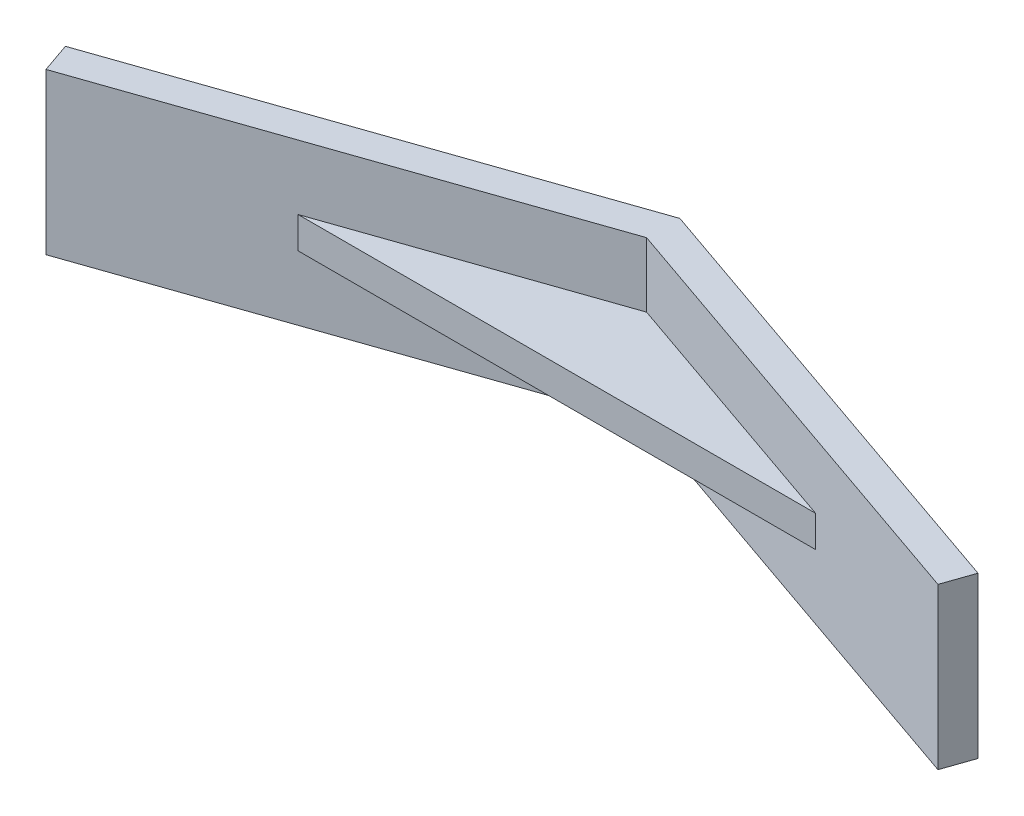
ISO-10303-21;
HEADER;
FILE_DESCRIPTION(('STEP AP214'),'2;1');
FILE_NAME('part.step','',(''),(''),'','','');
FILE_SCHEMA(('AUTOMOTIVE_DESIGN { 1 0 10303 214 1 1 1 1 }'));
ENDSEC;
DATA;
#1=APPLICATION_CONTEXT('core data for automotive mechanical design processes');
#2=APPLICATION_PROTOCOL_DEFINITION('international standard','automotive_design',2000,#1);
#3=PRODUCT_CONTEXT('',#1,'mechanical');
#4=PRODUCT('Part','Part','',(#3));
#5=PRODUCT_RELATED_PRODUCT_CATEGORY('part','',(#4));
#6=PRODUCT_DEFINITION_FORMATION('','',#4);
#7=PRODUCT_DEFINITION_CONTEXT('part definition',#1,'design');
#8=PRODUCT_DEFINITION('design','',#6,#7);
#9=PRODUCT_DEFINITION_SHAPE('','',#8);
#10=(LENGTH_UNIT() NAMED_UNIT(*) SI_UNIT(.MILLI.,.METRE.));
#11=(NAMED_UNIT(*) PLANE_ANGLE_UNIT() SI_UNIT($,.RADIAN.));
#12=(NAMED_UNIT(*) SI_UNIT($,.STERADIAN.) SOLID_ANGLE_UNIT());
#13=UNCERTAINTY_MEASURE_WITH_UNIT(LENGTH_MEASURE(1.E-05),#10,'distance_accuracy_value','');
#14=(GEOMETRIC_REPRESENTATION_CONTEXT(3) GLOBAL_UNCERTAINTY_ASSIGNED_CONTEXT((#13)) GLOBAL_UNIT_ASSIGNED_CONTEXT((#10,
#11,#12)) REPRESENTATION_CONTEXT('',''));
#15=CARTESIAN_POINT('',(0.,0.,0.));
#16=DIRECTION('',(0.,0.,1.));
#17=DIRECTION('',(1.,0.,0.));
#18=AXIS2_PLACEMENT_3D('',#15,#16,#17);
#19=CARTESIAN_POINT('',(-141.725429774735,25.5,0.));
#20=DIRECTION('',(0.944836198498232,0.,-0.327543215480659));
#21=DIRECTION('',(-0.327543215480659,0.,-0.944836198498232));
#22=AXIS2_PLACEMENT_3D('',#19,#20,#21);
#23=PLANE('',#22);
#24=DIRECTION('',(0.327543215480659,0.,0.944836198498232));
#25=VECTOR('',#24,1.);
#26=CARTESIAN_POINT('',(-141.725429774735,-25.5,0.));
#27=LINE('',#26,#25);
#28=CARTESIAN_POINT('',(-145.000861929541,-25.5,-9.4483619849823));
#29=VERTEX_POINT('',#28);
#30=CARTESIAN_POINT('',(-141.725429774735,-25.5,0.));
#31=VERTEX_POINT('',#30);
#32=EDGE_CURVE('E131',#29,#31,#27,.T.);
#33=ORIENTED_EDGE('',*,*,#32,.T.);
#34=DIRECTION('',(0.,-1.,0.));
#35=VECTOR('',#34,1.);
#36=CARTESIAN_POINT('',(-141.725429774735,25.5,0.));
#37=LINE('',#36,#35);
#38=CARTESIAN_POINT('',(-141.725429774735,25.5,0.));
#39=VERTEX_POINT('',#38);
#40=EDGE_CURVE('E11',#39,#31,#37,.T.);
#41=ORIENTED_EDGE('',*,*,#40,.F.);
#42=DIRECTION('',(0.327543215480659,0.,0.944836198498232));
#43=VECTOR('',#42,1.);
#44=CARTESIAN_POINT('',(-141.725429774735,25.5,0.));
#45=LINE('',#44,#43);
#46=CARTESIAN_POINT('',(-145.000861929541,25.5,-9.4483619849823));
#47=VERTEX_POINT('',#46);
#48=EDGE_CURVE('E132',#47,#39,#45,.T.);
#49=ORIENTED_EDGE('',*,*,#48,.F.);
#50=DIRECTION('',(0.,-1.,0.));
#51=VECTOR('',#50,1.);
#52=CARTESIAN_POINT('',(-145.000861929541,25.5,-9.4483619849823));
#53=LINE('',#52,#51);
#54=EDGE_CURVE('E146',#47,#29,#53,.T.);
#55=ORIENTED_EDGE('',*,*,#54,.T.);
#56=EDGE_LOOP('',(#33,#41,#49,#55));
#57=FACE_BOUND('',#56,.T.);
#58=ADVANCED_FACE('F36',(#57),#23,.F.);
#59=CARTESIAN_POINT('',(-141.725429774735,25.5,0.));
#60=DIRECTION('',(-0.327543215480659,0.,-0.944836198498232));
#61=DIRECTION('',(-0.944836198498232,0.,0.327543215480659));
#62=AXIS2_PLACEMENT_3D('',#59,#60,#61);
#63=PLANE('',#62);
#64=DIRECTION('',(0.,1.,0.));
#65=VECTOR('',#64,1.);
#66=CARTESIAN_POINT('',(-82.2319660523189,25.5,-20.6244007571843));
#67=LINE('',#66,#65);
#68=CARTESIAN_POINT('',(-82.2319660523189,-5.,-20.6244007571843));
#69=VERTEX_POINT('',#68);
#70=CARTESIAN_POINT('',(-82.2319660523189,5.,-20.6244007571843));
#71=VERTEX_POINT('',#70);
#72=EDGE_CURVE('E50',#69,#71,#67,.T.);
#73=ORIENTED_EDGE('',*,*,#72,.T.);
#74=DIRECTION('',(0.944836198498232,0.,-0.327543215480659));
#75=VECTOR('',#74,1.);
#76=CARTESIAN_POINT('',(-141.725429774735,5.,0.));
#77=LINE('',#76,#75);
#78=CARTESIAN_POINT('',(0.,5.,-49.1314823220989));
#79=VERTEX_POINT('',#78);
#80=EDGE_CURVE('E115',#71,#79,#77,.T.);
#81=ORIENTED_EDGE('',*,*,#80,.T.);
#82=DIRECTION('',(0.,-1.,0.));
#83=VECTOR('',#82,1.);
#84=CARTESIAN_POINT('',(0.,25.5,-49.1314823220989));
#85=LINE('',#84,#83);
#86=CARTESIAN_POINT('',(0.,25.5,-49.1314823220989));
#87=VERTEX_POINT('',#86);
#88=EDGE_CURVE('E43',#87,#79,#85,.T.);
#89=ORIENTED_EDGE('',*,*,#88,.F.);
#90=DIRECTION('',(0.944836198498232,0.,-0.327543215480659));
#91=VECTOR('',#90,1.);
#92=CARTESIAN_POINT('',(-141.725429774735,25.5,0.));
#93=LINE('',#92,#91);
#94=EDGE_CURVE('E135',#39,#87,#93,.T.);
#95=ORIENTED_EDGE('',*,*,#94,.F.);
#96=ORIENTED_EDGE('',*,*,#40,.T.);
#97=DIRECTION('',(0.944836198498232,0.,-0.327543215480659));
#98=VECTOR('',#97,1.);
#99=CARTESIAN_POINT('',(-141.725429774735,-25.5,0.));
#100=LINE('',#99,#98);
#101=CARTESIAN_POINT('',(0.,-25.5,-49.1314823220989));
#102=VERTEX_POINT('',#101);
#103=EDGE_CURVE('E149',#31,#102,#100,.T.);
#104=ORIENTED_EDGE('',*,*,#103,.T.);
#105=CARTESIAN_POINT('',(0.,-5.,-49.1314823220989));
#106=VERTEX_POINT('',#105);
#107=EDGE_CURVE('E169',#106,#102,#85,.T.);
#108=ORIENTED_EDGE('',*,*,#107,.F.);
#109=DIRECTION('',(0.944836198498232,0.,-0.327543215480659));
#110=VECTOR('',#109,1.);
#111=CARTESIAN_POINT('',(-141.725429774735,-5.,0.));
#112=LINE('',#111,#110);
#113=EDGE_CURVE('E55',#69,#106,#112,.T.);
#114=ORIENTED_EDGE('',*,*,#113,.F.);
#115=EDGE_LOOP('',(#73,#81,#89,#95,#96,#104,#108,#114));
#116=FACE_BOUND('',#115,.T.);
#117=ADVANCED_FACE('F174',(#116),#63,.F.);
#118=CARTESIAN_POINT('',(141.725429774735,25.5,0.));
#119=DIRECTION('',(0.327543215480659,0.,-0.944836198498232));
#120=DIRECTION('',(-0.944836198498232,0.,-0.327543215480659));
#121=AXIS2_PLACEMENT_3D('',#118,#119,#120);
#122=PLANE('',#121);
#123=ORIENTED_EDGE('',*,*,#88,.T.);
#124=DIRECTION('',(0.944836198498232,0.,0.327543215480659));
#125=VECTOR('',#124,1.);
#126=CARTESIAN_POINT('',(141.725429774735,5.,0.));
#127=LINE('',#126,#125);
#128=CARTESIAN_POINT('',(82.2319660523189,5.,-20.6244007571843));
#129=VERTEX_POINT('',#128);
#130=EDGE_CURVE('E110',#79,#129,#127,.T.);
#131=ORIENTED_EDGE('',*,*,#130,.T.);
#132=DIRECTION('',(0.,-1.,0.));
#133=VECTOR('',#132,1.);
#134=CARTESIAN_POINT('',(82.2319660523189,25.5,-20.6244007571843));
#135=LINE('',#134,#133);
#136=CARTESIAN_POINT('',(82.2319660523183,-5.,-20.6244007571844));
#137=VERTEX_POINT('',#136);
#138=EDGE_CURVE('E104',#129,#137,#135,.T.);
#139=ORIENTED_EDGE('',*,*,#138,.T.);
#140=DIRECTION('',(0.944836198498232,0.,0.327543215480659));
#141=VECTOR('',#140,1.);
#142=CARTESIAN_POINT('',(141.725429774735,-5.,0.));
#143=LINE('',#142,#141);
#144=EDGE_CURVE('E108',#106,#137,#143,.T.);
#145=ORIENTED_EDGE('',*,*,#144,.F.);
#146=ORIENTED_EDGE('',*,*,#107,.T.);
#147=DIRECTION('',(0.944836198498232,0.,0.327543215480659));
#148=VECTOR('',#147,1.);
#149=CARTESIAN_POINT('',(141.725429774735,-25.5,0.));
#150=LINE('',#149,#148);
#151=CARTESIAN_POINT('',(141.725429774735,-25.5,0.));
#152=VERTEX_POINT('',#151);
#153=EDGE_CURVE('E152',#102,#152,#150,.T.);
#154=ORIENTED_EDGE('',*,*,#153,.T.);
#155=DIRECTION('',(0.,-1.,0.));
#156=VECTOR('',#155,1.);
#157=CARTESIAN_POINT('',(141.725429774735,25.5,0.));
#158=LINE('',#157,#156);
#159=CARTESIAN_POINT('',(141.725429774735,25.5,0.));
#160=VERTEX_POINT('',#159);
#161=EDGE_CURVE('E167',#160,#152,#158,.T.);
#162=ORIENTED_EDGE('',*,*,#161,.F.);
#163=DIRECTION('',(0.944836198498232,0.,0.327543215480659));
#164=VECTOR('',#163,1.);
#165=CARTESIAN_POINT('',(141.725429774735,25.5,0.));
#166=LINE('',#165,#164);
#167=EDGE_CURVE('E138',#87,#160,#166,.T.);
#168=ORIENTED_EDGE('',*,*,#167,.F.);
#169=EDGE_LOOP('',(#123,#131,#139,#145,#146,#154,#162,#168));
#170=FACE_BOUND('',#169,.T.);
#171=ADVANCED_FACE('F107',(#170),#122,.F.);
#172=CARTESIAN_POINT('',(141.725429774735,25.5,0.));
#173=DIRECTION('',(-0.944836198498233,0.,-0.327543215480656));
#174=DIRECTION('',(-0.327543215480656,0.,0.944836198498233));
#175=AXIS2_PLACEMENT_3D('',#172,#173,#174);
#176=PLANE('',#175);
#177=DIRECTION('',(0.327543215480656,0.,-0.944836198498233));
#178=VECTOR('',#177,1.);
#179=CARTESIAN_POINT('',(141.725429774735,-25.5,0.));
#180=LINE('',#179,#178);
#181=CARTESIAN_POINT('',(145.000861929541,-25.5,-9.4483619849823));
#182=VERTEX_POINT('',#181);
#183=EDGE_CURVE('E154',#152,#182,#180,.T.);
#184=ORIENTED_EDGE('',*,*,#183,.T.);
#185=DIRECTION('',(0.,-1.,0.));
#186=VECTOR('',#185,1.);
#187=CARTESIAN_POINT('',(145.000861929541,25.5,-9.4483619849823));
#188=LINE('',#187,#186);
#189=CARTESIAN_POINT('',(145.000861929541,25.5,-9.4483619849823));
#190=VERTEX_POINT('',#189);
#191=EDGE_CURVE('E164',#190,#182,#188,.T.);
#192=ORIENTED_EDGE('',*,*,#191,.F.);
#193=DIRECTION('',(0.327543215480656,0.,-0.944836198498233));
#194=VECTOR('',#193,1.);
#195=CARTESIAN_POINT('',(141.725429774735,25.5,0.));
#196=LINE('',#195,#194);
#197=EDGE_CURVE('E140',#160,#190,#196,.T.);
#198=ORIENTED_EDGE('',*,*,#197,.F.);
#199=ORIENTED_EDGE('',*,*,#161,.T.);
#200=EDGE_LOOP('',(#184,#192,#198,#199));
#201=FACE_BOUND('',#200,.T.);
#202=ADVANCED_FACE('F184',(#201),#176,.F.);
#203=CARTESIAN_POINT('',(0.,25.5,-59.7153274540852));
#204=DIRECTION('',(-0.32754321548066,0.,0.944836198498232));
#205=DIRECTION('',(0.944836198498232,0.,0.32754321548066));
#206=AXIS2_PLACEMENT_3D('',#203,#204,#205);
#207=PLANE('',#206);
#208=DIRECTION('',(-0.944836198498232,0.,-0.32754321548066));
#209=VECTOR('',#208,1.);
#210=CARTESIAN_POINT('',(0.,-25.5,-59.7153274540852));
#211=LINE('',#210,#209);
#212=CARTESIAN_POINT('',(0.,-25.5,-59.7153274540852));
#213=VERTEX_POINT('',#212);
#214=EDGE_CURVE('E156',#182,#213,#211,.T.);
#215=ORIENTED_EDGE('',*,*,#214,.T.);
#216=DIRECTION('',(0.,-1.,0.));
#217=VECTOR('',#216,1.);
#218=CARTESIAN_POINT('',(0.,25.5,-59.7153274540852));
#219=LINE('',#218,#217);
#220=CARTESIAN_POINT('',(0.,25.5,-59.7153274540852));
#221=VERTEX_POINT('',#220);
#222=EDGE_CURVE('E162',#221,#213,#219,.T.);
#223=ORIENTED_EDGE('',*,*,#222,.F.);
#224=DIRECTION('',(-0.944836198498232,0.,-0.32754321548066));
#225=VECTOR('',#224,1.);
#226=CARTESIAN_POINT('',(0.,25.5,-59.7153274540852));
#227=LINE('',#226,#225);
#228=EDGE_CURVE('E142',#190,#221,#227,.T.);
#229=ORIENTED_EDGE('',*,*,#228,.F.);
#230=ORIENTED_EDGE('',*,*,#191,.T.);
#231=EDGE_LOOP('',(#215,#223,#229,#230));
#232=FACE_BOUND('',#231,.T.);
#233=ADVANCED_FACE('F188',(#232),#207,.F.);
#234=CARTESIAN_POINT('',(0.,25.5,-59.7153274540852));
#235=DIRECTION('',(0.32754321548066,0.,0.944836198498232));
#236=DIRECTION('',(0.944836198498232,0.,-0.32754321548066));
#237=AXIS2_PLACEMENT_3D('',#234,#235,#236);
#238=PLANE('',#237);
#239=ORIENTED_EDGE('',*,*,#222,.T.);
#240=DIRECTION('',(-0.944836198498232,0.,0.32754321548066));
#241=VECTOR('',#240,1.);
#242=CARTESIAN_POINT('',(0.,-25.5,-59.7153274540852));
#243=LINE('',#242,#241);
#244=EDGE_CURVE('E136',#213,#29,#243,.T.);
#245=ORIENTED_EDGE('',*,*,#244,.T.);
#246=ORIENTED_EDGE('',*,*,#54,.F.);
#247=DIRECTION('',(-0.944836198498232,0.,0.32754321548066));
#248=VECTOR('',#247,1.);
#249=CARTESIAN_POINT('',(0.,25.5,-59.7153274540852));
#250=LINE('',#249,#248);
#251=EDGE_CURVE('E144',#221,#47,#250,.T.);
#252=ORIENTED_EDGE('',*,*,#251,.F.);
#253=EDGE_LOOP('',(#239,#245,#246,#252));
#254=FACE_BOUND('',#253,.T.);
#255=ADVANCED_FACE('F211',(#254),#238,.F.);
#256=CARTESIAN_POINT('',(0.,25.5,0.));
#257=DIRECTION('',(0.,1.,0.));
#258=DIRECTION('',(0.,0.,1.));
#259=AXIS2_PLACEMENT_3D('',#256,#257,#258);
#260=PLANE('',#259);
#261=ORIENTED_EDGE('',*,*,#48,.T.);
#262=ORIENTED_EDGE('',*,*,#94,.T.);
#263=ORIENTED_EDGE('',*,*,#167,.T.);
#264=ORIENTED_EDGE('',*,*,#197,.T.);
#265=ORIENTED_EDGE('',*,*,#228,.T.);
#266=ORIENTED_EDGE('',*,*,#251,.T.);
#267=EDGE_LOOP('',(#261,#262,#263,#264,#265,#266));
#268=FACE_BOUND('',#267,.T.);
#269=ADVANCED_FACE('F192',(#268),#260,.T.);
#270=CARTESIAN_POINT('',(0.,-25.5,0.));
#271=DIRECTION('',(0.,1.,0.));
#272=DIRECTION('',(0.,0.,1.));
#273=AXIS2_PLACEMENT_3D('',#270,#271,#272);
#274=PLANE('',#273);
#275=ORIENTED_EDGE('',*,*,#32,.F.);
#276=ORIENTED_EDGE('',*,*,#244,.F.);
#277=ORIENTED_EDGE('',*,*,#214,.F.);
#278=ORIENTED_EDGE('',*,*,#183,.F.);
#279=ORIENTED_EDGE('',*,*,#153,.F.);
#280=ORIENTED_EDGE('',*,*,#103,.F.);
#281=EDGE_LOOP('',(#275,#276,#277,#278,#279,#280));
#282=FACE_BOUND('',#281,.T.);
#283=ADVANCED_FACE('F179',(#282),#274,.F.);
#284=CARTESIAN_POINT('',(-82.2319660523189,0.,-20.6244007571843));
#285=DIRECTION('',(0.,0.,1.));
#286=DIRECTION('',(1.,0.,0.));
#287=AXIS2_PLACEMENT_3D('',#284,#285,#286);
#288=PLANE('',#287);
#289=ORIENTED_EDGE('',*,*,#72,.F.);
#290=DIRECTION('',(1.,0.,0.));
#291=VECTOR('',#290,1.);
#292=CARTESIAN_POINT('',(0.,-5.,-20.6244007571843));
#293=LINE('',#292,#291);
#294=EDGE_CURVE('E120',#69,#137,#293,.T.);
#295=ORIENTED_EDGE('',*,*,#294,.T.);
#296=ORIENTED_EDGE('',*,*,#138,.F.);
#297=DIRECTION('',(1.,0.,0.));
#298=VECTOR('',#297,1.);
#299=CARTESIAN_POINT('',(0.,5.,-20.6244007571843));
#300=LINE('',#299,#298);
#301=EDGE_CURVE('E121',#71,#129,#300,.T.);
#302=ORIENTED_EDGE('',*,*,#301,.F.);
#303=EDGE_LOOP('',(#289,#295,#296,#302));
#304=FACE_BOUND('',#303,.T.);
#305=ADVANCED_FACE('F123',(#304),#288,.T.);
#306=CARTESIAN_POINT('',(0.,5.,-29.8576637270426));
#307=DIRECTION('',(0.,1.,0.));
#308=DIRECTION('',(0.,0.,1.));
#309=AXIS2_PLACEMENT_3D('',#306,#307,#308);
#310=PLANE('',#309);
#311=ORIENTED_EDGE('',*,*,#80,.F.);
#312=ORIENTED_EDGE('',*,*,#301,.T.);
#313=ORIENTED_EDGE('',*,*,#130,.F.);
#314=EDGE_LOOP('',(#311,#312,#313));
#315=FACE_BOUND('',#314,.T.);
#316=ADVANCED_FACE('F196',(#315),#310,.T.);
#317=CARTESIAN_POINT('',(0.,-5.,-29.8576637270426));
#318=DIRECTION('',(0.,1.,0.));
#319=DIRECTION('',(0.,0.,1.));
#320=AXIS2_PLACEMENT_3D('',#317,#318,#319);
#321=PLANE('',#320);
#322=ORIENTED_EDGE('',*,*,#294,.F.);
#323=ORIENTED_EDGE('',*,*,#113,.T.);
#324=ORIENTED_EDGE('',*,*,#144,.T.);
#325=EDGE_LOOP('',(#322,#323,#324));
#326=FACE_BOUND('',#325,.T.);
#327=ADVANCED_FACE('F119',(#326),#321,.F.);
#328=CLOSED_SHELL('',(#58,#117,#171,#202,#233,#255,#269,#283,#305,#316,#327));
#329=MANIFOLD_SOLID_BREP('B2',#328);
#330=ADVANCED_BREP_SHAPE_REPRESENTATION('',(#18,#329),#14);
#331=SHAPE_DEFINITION_REPRESENTATION(#9,#330);
ENDSEC;
END-ISO-10303-21;
